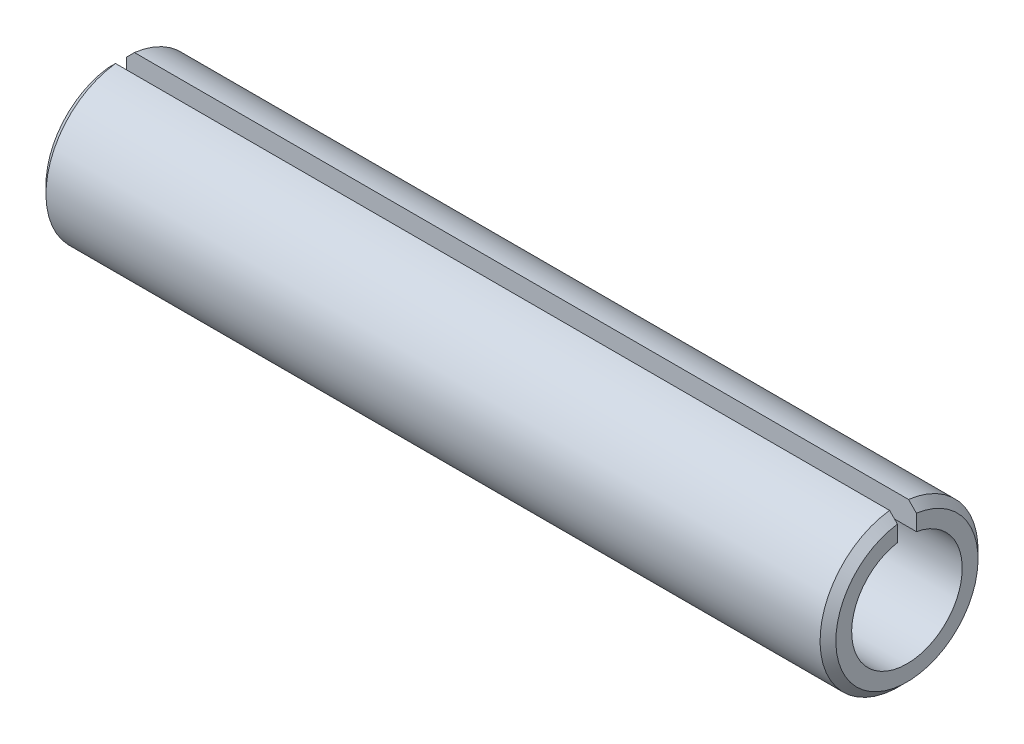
from build123d import *

# Parameters (mm, degrees)
ENL_V_MAT_EXTRU_2_DEPTH = 21.199009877


with BuildPart() as part:
    # Esquisse1 → Base-R_volution (revolve)
    with BuildSketch(Plane.XY):
        Polygon((0, 1.4), (0, 1.8), (0.2, 2), (19.8, 2), (20, 1.8), (20, 1.4), align=None)
    revolve(axis=Axis((0, 0, 0), (1, 0, 0)))

    # Esquisse2 → Enl_v. mat.-Extru.2 (cut, through all)
    with BuildSketch(Plane(origin=(0, 0, 0), x_dir=(0, 0, -1), z_dir=(1, 0, 0))):
        with BuildLine():
            Line((0.24, 1.985547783), (0.24, 1.379275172))
            ThreePointArc((0.24, 1.379275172), (0, 1.4), (-0.24, 1.379275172))
            Line((-0.24, 1.379275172), (-0.24, 1.985547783))
            ThreePointArc((-0.24, 1.985547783), (0, 2), (0.24, 1.985547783))
        make_face()
    extrude(amount=ENL_V_MAT_EXTRU_2_DEPTH, mode=Mode.SUBTRACT)


solid = part.part
